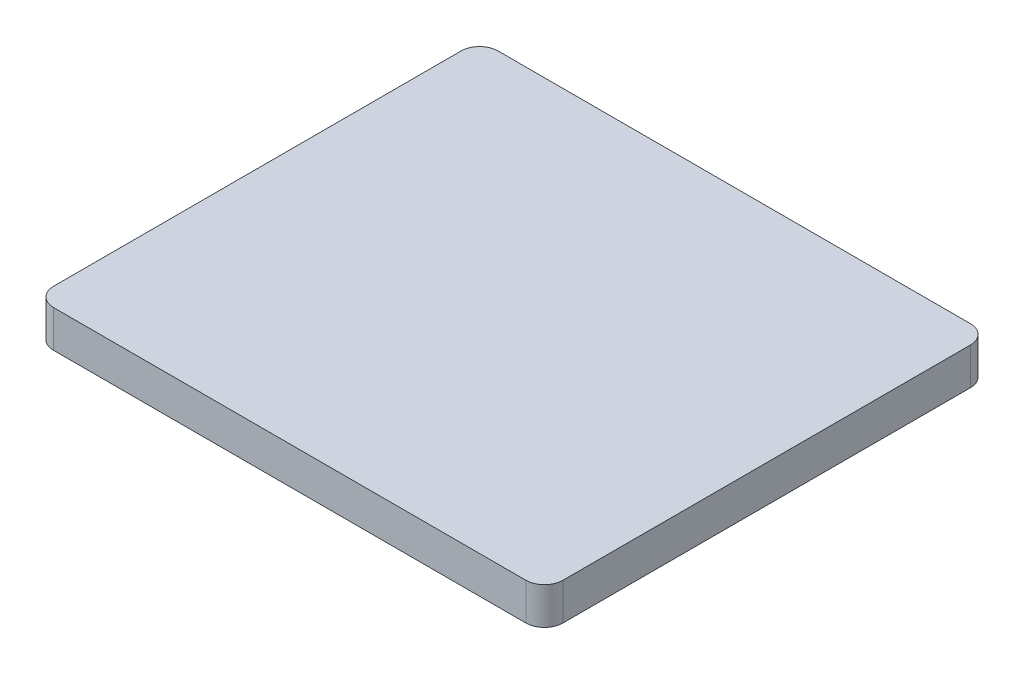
from build123d import *

# Parameters (mm, degrees)
SKETCH1_W           = 550
SKETCH1_H           = 480
BOSS_EXTRUDE1_DEPTH = 40
FILLET1_R           = 20


with BuildPart() as part:
    # Sketch1 → Boss-Extrude1 (new body)
    with BuildSketch(Plane(origin=(0, 0, 0), x_dir=(1, 0, 0), z_dir=(0, 1, 0))):
        Rectangle(SKETCH1_W, SKETCH1_H)
    extrude(amount=BOSS_EXTRUDE1_DEPTH)

    # Fillet1
    fillet1_edges = [part.edges().sort_by_distance(p)[0] for p in [
        (275, 20, 240),
        (-275, 20, 240),
        (-275, 20, -240),
        (275, 20, -240),
    ]]
    fillet(fillet1_edges, radius=FILLET1_R)


solid = part.part
